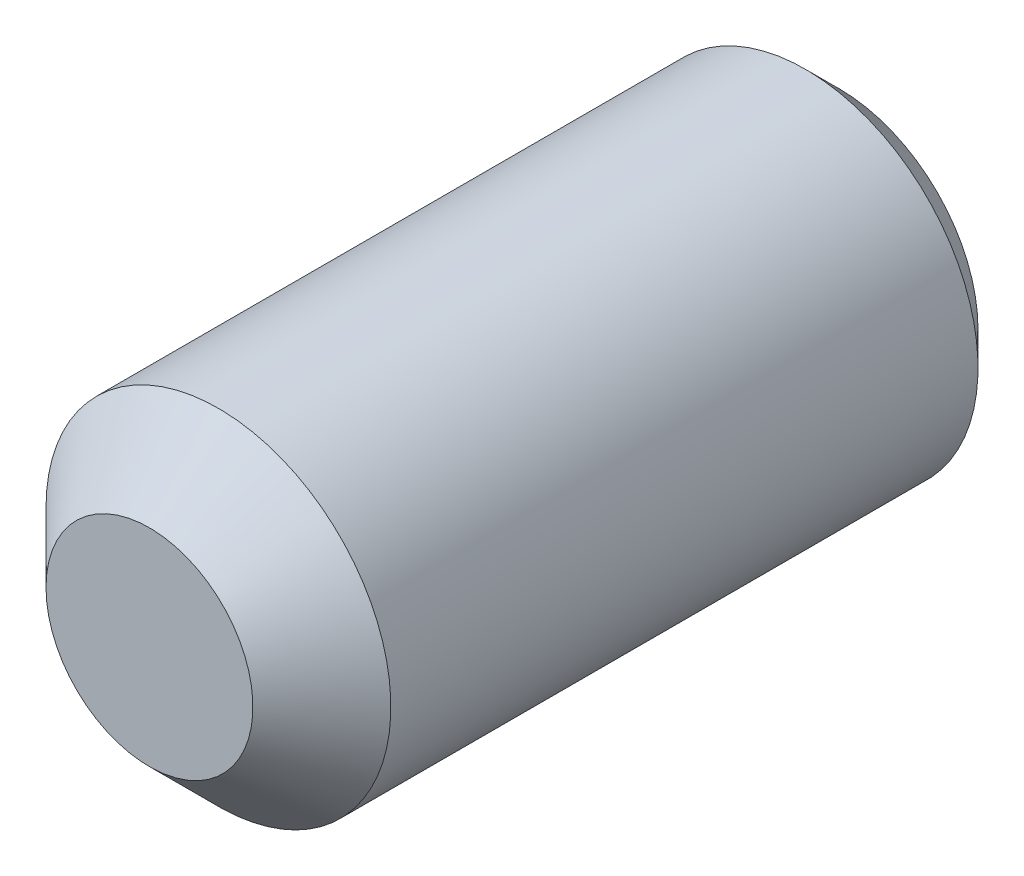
ISO-10303-21;
HEADER;
FILE_DESCRIPTION(('STEP AP214'),'2;1');
FILE_NAME('part.step','',(''),(''),'','','');
FILE_SCHEMA(('AUTOMOTIVE_DESIGN { 1 0 10303 214 1 1 1 1 }'));
ENDSEC;
DATA;
#1=APPLICATION_CONTEXT('core data for automotive mechanical design processes');
#2=APPLICATION_PROTOCOL_DEFINITION('international standard','automotive_design',2000,#1);
#3=PRODUCT_CONTEXT('',#1,'mechanical');
#4=PRODUCT('Part','Part','',(#3));
#5=PRODUCT_RELATED_PRODUCT_CATEGORY('part','',(#4));
#6=PRODUCT_DEFINITION_FORMATION('','',#4);
#7=PRODUCT_DEFINITION_CONTEXT('part definition',#1,'design');
#8=PRODUCT_DEFINITION('design','',#6,#7);
#9=PRODUCT_DEFINITION_SHAPE('','',#8);
#10=(LENGTH_UNIT() NAMED_UNIT(*) SI_UNIT(.MILLI.,.METRE.));
#11=(NAMED_UNIT(*) PLANE_ANGLE_UNIT() SI_UNIT($,.RADIAN.));
#12=(NAMED_UNIT(*) SI_UNIT($,.STERADIAN.) SOLID_ANGLE_UNIT());
#13=UNCERTAINTY_MEASURE_WITH_UNIT(LENGTH_MEASURE(1.E-05),#10,'distance_accuracy_value','');
#14=(GEOMETRIC_REPRESENTATION_CONTEXT(3) GLOBAL_UNCERTAINTY_ASSIGNED_CONTEXT((#13)) GLOBAL_UNIT_ASSIGNED_CONTEXT((#10,
#11,#12)) REPRESENTATION_CONTEXT('',''));
#15=CARTESIAN_POINT('',(0.,0.,0.));
#16=DIRECTION('',(0.,0.,1.));
#17=DIRECTION('',(1.,0.,0.));
#18=AXIS2_PLACEMENT_3D('',#15,#16,#17);
#19=CARTESIAN_POINT('',(-31.7646511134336,8.40329341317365,1.20000000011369));
#20=DIRECTION('',(0.,0.,-1.));
#21=DIRECTION('',(-1.,0.,0.));
#22=AXIS2_PLACEMENT_3D('',#19,#20,#21);
#23=PLANE('',#22);
#24=CARTESIAN_POINT('',(-31.0140957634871,8.40329341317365,1.20000000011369));
#25=DIRECTION('',(0.,0.,-1.));
#26=DIRECTION('',(-1.,0.,0.));
#27=AXIS2_PLACEMENT_3D('',#24,#25,#26);
#28=CIRCLE('',#27,0.65);
#29=CARTESIAN_POINT('',(-31.577012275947,8.72829341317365,1.20000000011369));
#30=VERTEX_POINT('',#29);
#31=CARTESIAN_POINT('',(-31.0140957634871,9.05329341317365,1.20000000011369));
#32=VERTEX_POINT('',#31);
#33=EDGE_CURVE('E56',#30,#32,#28,.T.);
#34=ORIENTED_EDGE('',*,*,#33,.F.);
#35=DIRECTION('',(0.5,0.866025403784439,0.));
#36=VECTOR('',#35,1.);
#37=CARTESIAN_POINT('',(-31.7646511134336,8.40329341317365,1.20000000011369));
#38=LINE('',#37,#36);
#39=CARTESIAN_POINT('',(-31.3893734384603,9.05329341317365,1.20000000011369));
#40=VERTEX_POINT('',#39);
#41=EDGE_CURVE('E266',#30,#40,#38,.T.);
#42=ORIENTED_EDGE('',*,*,#41,.T.);
#43=DIRECTION('',(1.,0.,0.));
#44=VECTOR('',#43,1.);
#45=CARTESIAN_POINT('',(-31.3893734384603,9.05329341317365,1.20000000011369));
#46=LINE('',#45,#44);
#47=EDGE_CURVE('E257',#40,#32,#46,.T.);
#48=ORIENTED_EDGE('',*,*,#47,.T.);
#49=EDGE_LOOP('',(#34,#42,#48));
#50=FACE_BOUND('',#49,.T.);
#51=ADVANCED_FACE('F44',(#50),#23,.T.);
#52=CARTESIAN_POINT('',(-30.4511792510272,8.72829341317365,1.20000000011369));
#53=VERTEX_POINT('',#52);
#54=EDGE_CURVE('E11',#32,#53,#28,.T.);
#55=ORIENTED_EDGE('',*,*,#54,.F.);
#56=CARTESIAN_POINT('',(-30.6388180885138,9.05329341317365,1.20000000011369));
#57=VERTEX_POINT('',#56);
#58=EDGE_CURVE('E261',#32,#57,#46,.T.);
#59=ORIENTED_EDGE('',*,*,#58,.T.);
#60=DIRECTION('',(0.5,-0.866025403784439,0.));
#61=VECTOR('',#60,1.);
#62=CARTESIAN_POINT('',(-30.6388180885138,9.05329341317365,1.20000000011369));
#63=LINE('',#62,#61);
#64=EDGE_CURVE('E252',#57,#53,#63,.T.);
#65=ORIENTED_EDGE('',*,*,#64,.T.);
#66=EDGE_LOOP('',(#55,#59,#65));
#67=FACE_BOUND('',#66,.T.);
#68=ADVANCED_FACE('F132',(#67),#23,.T.);
#69=CARTESIAN_POINT('',(-30.4511792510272,8.07829341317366,1.20000000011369));
#70=VERTEX_POINT('',#69);
#71=EDGE_CURVE('E54',#53,#70,#28,.T.);
#72=ORIENTED_EDGE('',*,*,#71,.F.);
#73=CARTESIAN_POINT('',(-30.2635404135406,8.40329341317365,1.20000000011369));
#74=VERTEX_POINT('',#73);
#75=EDGE_CURVE('E256',#53,#74,#63,.T.);
#76=ORIENTED_EDGE('',*,*,#75,.T.);
#77=DIRECTION('',(-0.5,-0.866025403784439,0.));
#78=VECTOR('',#77,1.);
#79=CARTESIAN_POINT('',(-30.2635404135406,8.40329341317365,1.20000000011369));
#80=LINE('',#79,#78);
#81=EDGE_CURVE('E247',#74,#70,#80,.T.);
#82=ORIENTED_EDGE('',*,*,#81,.T.);
#83=EDGE_LOOP('',(#72,#76,#82));
#84=FACE_BOUND('',#83,.T.);
#85=ADVANCED_FACE('F137',(#84),#23,.T.);
#86=CARTESIAN_POINT('',(-31.0140957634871,7.75329341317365,1.20000000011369));
#87=VERTEX_POINT('',#86);
#88=EDGE_CURVE('E304',#70,#87,#28,.T.);
#89=ORIENTED_EDGE('',*,*,#88,.F.);
#90=CARTESIAN_POINT('',(-30.6388180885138,7.75329341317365,1.20000000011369));
#91=VERTEX_POINT('',#90);
#92=EDGE_CURVE('E251',#70,#91,#80,.T.);
#93=ORIENTED_EDGE('',*,*,#92,.T.);
#94=DIRECTION('',(-1.,0.,0.));
#95=VECTOR('',#94,1.);
#96=CARTESIAN_POINT('',(-30.6388180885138,7.75329341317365,1.20000000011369));
#97=LINE('',#96,#95);
#98=EDGE_CURVE('E206',#91,#87,#97,.T.);
#99=ORIENTED_EDGE('',*,*,#98,.T.);
#100=EDGE_LOOP('',(#89,#93,#99));
#101=FACE_BOUND('',#100,.T.);
#102=ADVANCED_FACE('F310',(#101),#23,.T.);
#103=CARTESIAN_POINT('',(-31.577012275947,8.07829341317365,1.20000000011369));
#104=VERTEX_POINT('',#103);
#105=EDGE_CURVE('E63',#87,#104,#28,.T.);
#106=ORIENTED_EDGE('',*,*,#105,.F.);
#107=CARTESIAN_POINT('',(-31.3893734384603,7.75329341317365,1.20000000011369));
#108=VERTEX_POINT('',#107);
#109=EDGE_CURVE('E246',#87,#108,#97,.T.);
#110=ORIENTED_EDGE('',*,*,#109,.T.);
#111=DIRECTION('',(-0.5,0.866025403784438,0.));
#112=VECTOR('',#111,1.);
#113=CARTESIAN_POINT('',(-31.3893734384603,7.75329341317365,1.20000000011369));
#114=LINE('',#113,#112);
#115=EDGE_CURVE('E267',#108,#104,#114,.T.);
#116=ORIENTED_EDGE('',*,*,#115,.T.);
#117=EDGE_LOOP('',(#106,#110,#116));
#118=FACE_BOUND('',#117,.T.);
#119=ADVANCED_FACE('F130',(#118),#23,.T.);
#120=CARTESIAN_POINT('',(-31.0140957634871,9.40979341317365,0.));
#121=DIRECTION('',(0.,0.,1.));
#122=DIRECTION('',(1.,0.,0.));
#123=AXIS2_PLACEMENT_3D('',#120,#121,#122);
#124=PLANE('',#123);
#125=DIRECTION('',(0.5,0.866025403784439,0.));
#126=VECTOR('',#125,1.);
#127=CARTESIAN_POINT('',(-31.7646511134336,8.40329341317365,1.13686837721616E-10));
#128=LINE('',#127,#126);
#129=CARTESIAN_POINT('',(-31.7646511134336,8.40329341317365,0.));
#130=VERTEX_POINT('',#129);
#131=CARTESIAN_POINT('',(-31.3893734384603,9.05329341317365,1.13686837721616E-10));
#132=VERTEX_POINT('',#131);
#133=EDGE_CURVE('E237',#130,#132,#128,.T.);
#134=ORIENTED_EDGE('',*,*,#133,.F.);
#135=DIRECTION('',(-0.5,0.866025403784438,0.));
#136=VECTOR('',#135,1.);
#137=CARTESIAN_POINT('',(-31.3893734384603,7.75329341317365,1.13686837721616E-10));
#138=LINE('',#137,#136);
#139=CARTESIAN_POINT('',(-31.3893734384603,7.75329341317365,1.13686837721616E-10));
#140=VERTEX_POINT('',#139);
#141=EDGE_CURVE('E71',#140,#130,#138,.T.);
#142=ORIENTED_EDGE('',*,*,#141,.F.);
#143=DIRECTION('',(-1.,0.,0.));
#144=VECTOR('',#143,1.);
#145=CARTESIAN_POINT('',(-30.6388180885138,7.75329341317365,1.13686837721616E-10));
#146=LINE('',#145,#144);
#147=CARTESIAN_POINT('',(-30.6388180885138,7.75329341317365,1.13686837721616E-10));
#148=VERTEX_POINT('',#147);
#149=EDGE_CURVE('E220',#148,#140,#146,.T.);
#150=ORIENTED_EDGE('',*,*,#149,.F.);
#151=DIRECTION('',(-0.5,-0.866025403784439,0.));
#152=VECTOR('',#151,1.);
#153=CARTESIAN_POINT('',(-30.2635404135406,8.40329341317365,1.13686837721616E-10));
#154=LINE('',#153,#152);
#155=CARTESIAN_POINT('',(-30.2635404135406,8.40329341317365,1.13686837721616E-10));
#156=VERTEX_POINT('',#155);
#157=EDGE_CURVE('E225',#156,#148,#154,.T.);
#158=ORIENTED_EDGE('',*,*,#157,.F.);
#159=DIRECTION('',(0.5,-0.866025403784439,0.));
#160=VECTOR('',#159,1.);
#161=CARTESIAN_POINT('',(-30.6388180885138,9.05329341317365,1.13686837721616E-10));
#162=LINE('',#161,#160);
#163=CARTESIAN_POINT('',(-30.6388180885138,9.05329341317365,1.13686837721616E-10));
#164=VERTEX_POINT('',#163);
#165=EDGE_CURVE('E229',#164,#156,#162,.T.);
#166=ORIENTED_EDGE('',*,*,#165,.F.);
#167=DIRECTION('',(1.,0.,0.));
#168=VECTOR('',#167,1.);
#169=CARTESIAN_POINT('',(-31.3893734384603,9.05329341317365,1.13686837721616E-10));
#170=LINE('',#169,#168);
#171=EDGE_CURVE('E233',#132,#164,#170,.T.);
#172=ORIENTED_EDGE('',*,*,#171,.F.);
#173=EDGE_LOOP('',(#134,#142,#150,#158,#166,#172));
#174=FACE_BOUND('',#173,.T.);
#175=CARTESIAN_POINT('',(-31.0140957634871,8.40329341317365,0.));
#176=DIRECTION('',(0.,0.,-1.));
#177=DIRECTION('',(-1.,0.,0.));
#178=AXIS2_PLACEMENT_3D('',#175,#176,#177);
#179=CIRCLE('',#178,1.0065);
#180=CARTESIAN_POINT('',(-32.0205957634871,8.40329341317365,0.));
#181=VERTEX_POINT('',#180);
#182=EDGE_CURVE('E195',#181,#181,#179,.T.);
#183=ORIENTED_EDGE('',*,*,#182,.T.);
#184=EDGE_LOOP('',(#183));
#185=FACE_BOUND('',#184,.T.);
#186=ADVANCED_FACE('F46',(#174,#185),#124,.F.);
#187=CARTESIAN_POINT('',(-31.0140957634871,8.40329341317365,5.));
#188=DIRECTION('',(0.,0.,-1.));
#189=DIRECTION('',(-1.,0.,0.));
#190=AXIS2_PLACEMENT_3D('',#187,#188,#189);
#191=PLANE('',#190);
#192=CARTESIAN_POINT('',(-31.0140957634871,8.40329341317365,5.));
#193=DIRECTION('',(0.,0.,-1.));
#194=DIRECTION('',(-1.,0.,0.));
#195=AXIS2_PLACEMENT_3D('',#192,#193,#194);
#196=CIRCLE('',#195,0.75);
#197=CARTESIAN_POINT('',(-31.7640957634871,8.40329341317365,5.));
#198=VERTEX_POINT('',#197);
#199=EDGE_CURVE('E48',#198,#198,#196,.T.);
#200=ORIENTED_EDGE('',*,*,#199,.F.);
#201=EDGE_LOOP('',(#200));
#202=FACE_BOUND('',#201,.T.);
#203=ADVANCED_FACE('F173',(#202),#191,.F.);
#204=CARTESIAN_POINT('',(-31.0140957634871,8.40329341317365,5.));
#205=DIRECTION('',(0.,0.,-1.));
#206=DIRECTION('',(-1.,0.,0.));
#207=AXIS2_PLACEMENT_3D('',#204,#205,#206);
#208=CONICAL_SURFACE('',#207,0.75,0.785398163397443);
#209=CARTESIAN_POINT('',(-31.0140957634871,8.40329341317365,4.49999999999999));
#210=DIRECTION('',(0.,0.,-1.));
#211=DIRECTION('',(-1.,0.,0.));
#212=AXIS2_PLACEMENT_3D('',#209,#210,#211);
#213=CIRCLE('',#212,1.25);
#214=CARTESIAN_POINT('',(-32.2640957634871,8.40329341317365,4.49999999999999));
#215=VERTEX_POINT('',#214);
#216=EDGE_CURVE('E186',#215,#215,#213,.T.);
#217=ORIENTED_EDGE('',*,*,#216,.F.);
#218=EDGE_LOOP('',(#217));
#219=FACE_BOUND('',#218,.T.);
#220=ORIENTED_EDGE('',*,*,#199,.T.);
#221=EDGE_LOOP('',(#220));
#222=FACE_BOUND('',#221,.T.);
#223=ADVANCED_FACE('F170',(#219,#222),#208,.T.);
#224=CARTESIAN_POINT('',(-31.0140957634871,8.40329341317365,-10.7450145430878));
#225=DIRECTION('',(0.,0.,-1.));
#226=DIRECTION('',(-1.,0.,0.));
#227=AXIS2_PLACEMENT_3D('',#224,#225,#226);
#228=CYLINDRICAL_SURFACE('',#227,1.25);
#229=CARTESIAN_POINT('',(-31.0140957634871,8.40329341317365,0.243500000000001));
#230=DIRECTION('',(0.,0.,-1.));
#231=DIRECTION('',(-1.,0.,0.));
#232=AXIS2_PLACEMENT_3D('',#229,#230,#231);
#233=CIRCLE('',#232,1.25);
#234=CARTESIAN_POINT('',(-32.2640957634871,8.40329341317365,0.243500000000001));
#235=VERTEX_POINT('',#234);
#236=EDGE_CURVE('E190',#235,#235,#233,.T.);
#237=ORIENTED_EDGE('',*,*,#236,.F.);
#238=EDGE_LOOP('',(#237));
#239=FACE_BOUND('',#238,.T.);
#240=ORIENTED_EDGE('',*,*,#216,.T.);
#241=EDGE_LOOP('',(#240));
#242=FACE_BOUND('',#241,.T.);
#243=ADVANCED_FACE('F166',(#239,#242),#228,.T.);
#244=CARTESIAN_POINT('',(-31.0140957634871,8.40329341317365,0.243500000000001));
#245=DIRECTION('',(0.,0.,1.));
#246=DIRECTION('',(1.,0.,0.));
#247=AXIS2_PLACEMENT_3D('',#244,#245,#246);
#248=CONICAL_SURFACE('',#247,1.25,0.785398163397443);
#249=ORIENTED_EDGE('',*,*,#182,.F.);
#250=EDGE_LOOP('',(#249));
#251=FACE_BOUND('',#250,.T.);
#252=ORIENTED_EDGE('',*,*,#236,.T.);
#253=EDGE_LOOP('',(#252));
#254=FACE_BOUND('',#253,.T.);
#255=ADVANCED_FACE('F163',(#251,#254),#248,.T.);
#256=CARTESIAN_POINT('',(-31.3893734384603,7.75329341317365,1.20000000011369));
#257=DIRECTION('',(-0.866025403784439,-0.5,0.));
#258=DIRECTION('',(0.5,-0.866025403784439,0.));
#259=AXIS2_PLACEMENT_3D('',#256,#257,#258);
#260=PLANE('',#259);
#261=ORIENTED_EDGE('',*,*,#141,.T.);
#262=DIRECTION('',(0.,0.,-1.));
#263=VECTOR('',#262,1.);
#264=CARTESIAN_POINT('',(-31.7646511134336,8.40329341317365,1.20000000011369));
#265=LINE('',#264,#263);
#266=CARTESIAN_POINT('',(-31.7646511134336,8.40329341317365,1.20000000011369));
#267=VERTEX_POINT('',#266);
#268=EDGE_CURVE('E202',#267,#130,#265,.T.);
#269=ORIENTED_EDGE('',*,*,#268,.F.);
#270=EDGE_CURVE('E224',#104,#267,#114,.T.);
#271=ORIENTED_EDGE('',*,*,#270,.F.);
#272=ORIENTED_EDGE('',*,*,#115,.F.);
#273=DIRECTION('',(0.,0.,-1.));
#274=VECTOR('',#273,1.);
#275=CARTESIAN_POINT('',(-31.3893734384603,7.75329341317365,1.20000000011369));
#276=LINE('',#275,#274);
#277=EDGE_CURVE('E201',#108,#140,#276,.T.);
#278=ORIENTED_EDGE('',*,*,#277,.T.);
#279=EDGE_LOOP('',(#261,#269,#271,#272,#278));
#280=FACE_BOUND('',#279,.T.);
#281=ADVANCED_FACE('F145',(#280),#260,.F.);
#282=CARTESIAN_POINT('',(-30.6388180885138,7.75329341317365,1.20000000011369));
#283=DIRECTION('',(0.,-1.,0.));
#284=DIRECTION('',(1.,0.,0.));
#285=AXIS2_PLACEMENT_3D('',#282,#283,#284);
#286=PLANE('',#285);
#287=ORIENTED_EDGE('',*,*,#149,.T.);
#288=ORIENTED_EDGE('',*,*,#277,.F.);
#289=ORIENTED_EDGE('',*,*,#109,.F.);
#290=ORIENTED_EDGE('',*,*,#98,.F.);
#291=DIRECTION('',(0.,0.,-1.));
#292=VECTOR('',#291,1.);
#293=CARTESIAN_POINT('',(-30.6388180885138,7.75329341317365,1.20000000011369));
#294=LINE('',#293,#292);
#295=EDGE_CURVE('E215',#91,#148,#294,.T.);
#296=ORIENTED_EDGE('',*,*,#295,.T.);
#297=EDGE_LOOP('',(#287,#288,#289,#290,#296));
#298=FACE_BOUND('',#297,.T.);
#299=ADVANCED_FACE('F141',(#298),#286,.F.);
#300=CARTESIAN_POINT('',(-30.2635404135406,8.40329341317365,1.20000000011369));
#301=DIRECTION('',(0.866025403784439,-0.5,0.));
#302=DIRECTION('',(0.5,0.866025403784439,0.));
#303=AXIS2_PLACEMENT_3D('',#300,#301,#302);
#304=PLANE('',#303);
#305=ORIENTED_EDGE('',*,*,#157,.T.);
#306=ORIENTED_EDGE('',*,*,#295,.F.);
#307=ORIENTED_EDGE('',*,*,#92,.F.);
#308=ORIENTED_EDGE('',*,*,#81,.F.);
#309=DIRECTION('',(0.,0.,-1.));
#310=VECTOR('',#309,1.);
#311=CARTESIAN_POINT('',(-30.2635404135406,8.40329341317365,1.20000000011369));
#312=LINE('',#311,#310);
#313=EDGE_CURVE('E212',#74,#156,#312,.T.);
#314=ORIENTED_EDGE('',*,*,#313,.T.);
#315=EDGE_LOOP('',(#305,#306,#307,#308,#314));
#316=FACE_BOUND('',#315,.T.);
#317=ADVANCED_FACE('F144',(#316),#304,.F.);
#318=CARTESIAN_POINT('',(-30.6388180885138,9.05329341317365,1.20000000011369));
#319=DIRECTION('',(0.866025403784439,0.5,0.));
#320=DIRECTION('',(-0.5,0.866025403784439,0.));
#321=AXIS2_PLACEMENT_3D('',#318,#319,#320);
#322=PLANE('',#321);
#323=ORIENTED_EDGE('',*,*,#165,.T.);
#324=ORIENTED_EDGE('',*,*,#313,.F.);
#325=ORIENTED_EDGE('',*,*,#75,.F.);
#326=ORIENTED_EDGE('',*,*,#64,.F.);
#327=DIRECTION('',(0.,0.,-1.));
#328=VECTOR('',#327,1.);
#329=CARTESIAN_POINT('',(-30.6388180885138,9.05329341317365,1.20000000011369));
#330=LINE('',#329,#328);
#331=EDGE_CURVE('E209',#57,#164,#330,.T.);
#332=ORIENTED_EDGE('',*,*,#331,.T.);
#333=EDGE_LOOP('',(#323,#324,#325,#326,#332));
#334=FACE_BOUND('',#333,.T.);
#335=ADVANCED_FACE('F149',(#334),#322,.F.);
#336=CARTESIAN_POINT('',(-31.3893734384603,9.05329341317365,1.20000000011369));
#337=DIRECTION('',(0.,1.,0.));
#338=DIRECTION('',(-1.,0.,0.));
#339=AXIS2_PLACEMENT_3D('',#336,#337,#338);
#340=PLANE('',#339);
#341=ORIENTED_EDGE('',*,*,#171,.T.);
#342=ORIENTED_EDGE('',*,*,#331,.F.);
#343=ORIENTED_EDGE('',*,*,#58,.F.);
#344=ORIENTED_EDGE('',*,*,#47,.F.);
#345=DIRECTION('',(0.,0.,-1.));
#346=VECTOR('',#345,1.);
#347=CARTESIAN_POINT('',(-31.3893734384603,9.05329341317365,1.20000000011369));
#348=LINE('',#347,#346);
#349=EDGE_CURVE('E205',#40,#132,#348,.T.);
#350=ORIENTED_EDGE('',*,*,#349,.T.);
#351=EDGE_LOOP('',(#341,#342,#343,#344,#350));
#352=FACE_BOUND('',#351,.T.);
#353=ADVANCED_FACE('F153',(#352),#340,.F.);
#354=CARTESIAN_POINT('',(-31.7646511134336,8.40329341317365,1.20000000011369));
#355=DIRECTION('',(-0.866025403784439,0.5,0.));
#356=DIRECTION('',(-0.5,-0.866025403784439,0.));
#357=AXIS2_PLACEMENT_3D('',#354,#355,#356);
#358=PLANE('',#357);
#359=ORIENTED_EDGE('',*,*,#133,.T.);
#360=ORIENTED_EDGE('',*,*,#349,.F.);
#361=ORIENTED_EDGE('',*,*,#41,.F.);
#362=EDGE_CURVE('E262',#267,#30,#38,.T.);
#363=ORIENTED_EDGE('',*,*,#362,.F.);
#364=ORIENTED_EDGE('',*,*,#268,.T.);
#365=EDGE_LOOP('',(#359,#360,#361,#363,#364));
#366=FACE_BOUND('',#365,.T.);
#367=ADVANCED_FACE('F127',(#366),#358,.F.);
#368=EDGE_CURVE('E185',#104,#30,#28,.T.);
#369=ORIENTED_EDGE('',*,*,#368,.F.);
#370=ORIENTED_EDGE('',*,*,#270,.T.);
#371=ORIENTED_EDGE('',*,*,#362,.T.);
#372=EDGE_LOOP('',(#369,#370,#371));
#373=FACE_BOUND('',#372,.T.);
#374=ADVANCED_FACE('F122',(#373),#23,.T.);
#375=CARTESIAN_POINT('',(-31.0140957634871,8.40329341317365,1.57527767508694));
#376=DIRECTION('',(0.,0.,-1.));
#377=DIRECTION('',(-1.,0.,0.));
#378=AXIS2_PLACEMENT_3D('',#375,#376,#377);
#379=CONICAL_SURFACE('',#378,0.,1.0471975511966);
#380=ORIENTED_EDGE('',*,*,#33,.T.);
#381=ORIENTED_EDGE('',*,*,#54,.T.);
#382=ORIENTED_EDGE('',*,*,#71,.T.);
#383=ORIENTED_EDGE('',*,*,#88,.T.);
#384=ORIENTED_EDGE('',*,*,#105,.T.);
#385=ORIENTED_EDGE('',*,*,#368,.T.);
#386=EDGE_LOOP('',(#380,#381,#382,#383,#384,#385));
#387=FACE_BOUND('',#386,.T.);
#388=CARTESIAN_POINT('',(-31.0140957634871,8.40329341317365,1.57527767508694));
#389=VERTEX_POINT('',#388);
#390=VERTEX_LOOP('',#389);
#391=FACE_BOUND('',#390,.T.);
#392=ADVANCED_FACE('F120',(#387,#391),#379,.F.);
#393=CLOSED_SHELL('',(#51,#68,#85,#102,#119,#186,#203,#223,#243,#255,#281,#299,#317,#335,#353,
#367,#374,#392));
#394=MANIFOLD_SOLID_BREP('B2',#393);
#395=ADVANCED_BREP_SHAPE_REPRESENTATION('',(#18,#394),#14);
#396=SHAPE_DEFINITION_REPRESENTATION(#9,#395);
ENDSEC;
END-ISO-10303-21;
